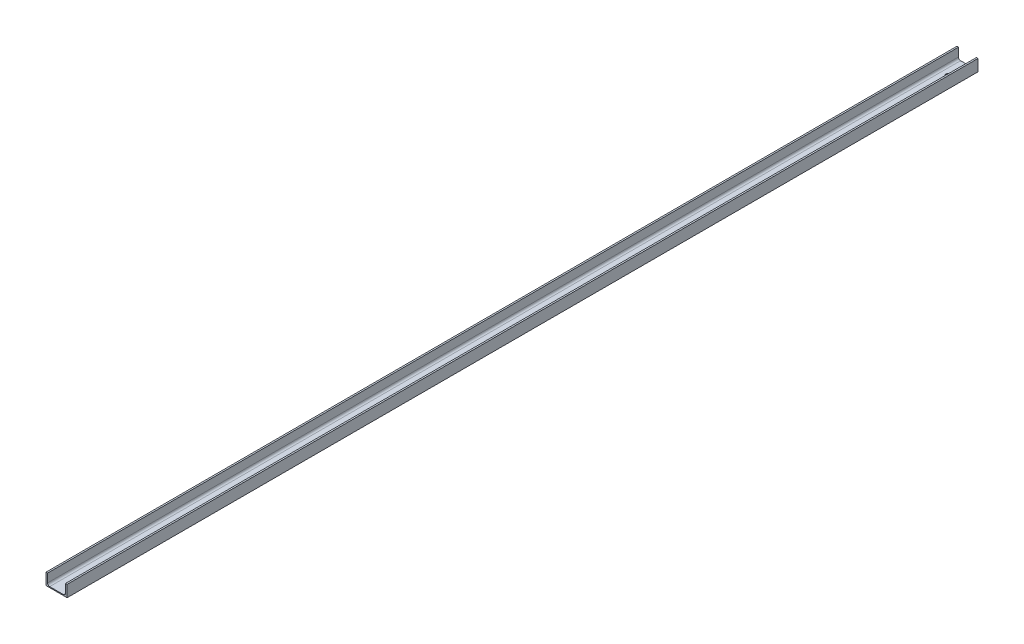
from build123d import *

# Parameters (mm, degrees)
EXTRUSION1_DEPTH        = 4317
ESQUISSE2_R             = 7.5
ESQUISSE2_R_2           = 12.5
ENL_V_MAT_EXTRU_1_DEPTH = 4319.453340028


with BuildPart() as part:
    # Esquisse1 → Extrusion1 (new body)
    with BuildSketch(Plane.XY):
        with BuildLine():
            Line((0, 0), (100, 0))
            Line((100, 0), (100, 55))
            Line((100, 55), (92.5, 55))
            Line((92.5, 55), (92.5, 14.5))
            ThreePointArc((92.5, 14.5), (89.571067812, 7.428932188), (82.5, 4.5))
            Line((82.5, 4.5), (17.5, 4.5))
            ThreePointArc((17.5, 4.5), (10.428932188, 7.428932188), (7.5, 14.5))
            Line((7.5, 14.5), (7.5, 55))
            Line((7.5, 55), (0, 55))
            Line((0, 55), (0, 0))
        make_face()
    extrude(amount=EXTRUSION1_DEPTH)

    # Esquisse2 → Enl_v. mat.-Extru.1 (cut, through all)
    with BuildSketch(Plane(origin=(0, 4.5, 0), x_dir=(-1, 0, 0), z_dir=(0, 1, 0))):
        with Locations((-50, 185)):
            Circle(ESQUISSE2_R)
        with Locations((-50, 494)):
            Circle(ESQUISSE2_R)
        with Locations((-50, 803)):
            Circle(ESQUISSE2_R)
        with Locations((-50, 1112)):
            Circle(ESQUISSE2_R)
        with Locations((-50, 1421)):
            Circle(ESQUISSE2_R)
        with Locations((-50, 1730)):
            Circle(ESQUISSE2_R)
        with Locations((-50, 2039)):
            Circle(ESQUISSE2_R)
        with Locations((-50, 2348)):
            Circle(ESQUISSE2_R)
        with Locations((-50, 2657)):
            Circle(ESQUISSE2_R)
        with Locations((-50, 2966)):
            Circle(ESQUISSE2_R)
        with Locations((-50, 3275)):
            Circle(ESQUISSE2_R)
        with Locations((-50, 3584)):
            Circle(ESQUISSE2_R)
        with Locations((-50, 3893)):
            Circle(ESQUISSE2_R)
        with Locations((-50, 4202)):
            Circle(ESQUISSE2_R)
        with Locations((-50, 90)):
            Circle(ESQUISSE2_R_2)
    extrude(amount=-ENL_V_MAT_EXTRU_1_DEPTH, mode=Mode.SUBTRACT)


solid = part.part
